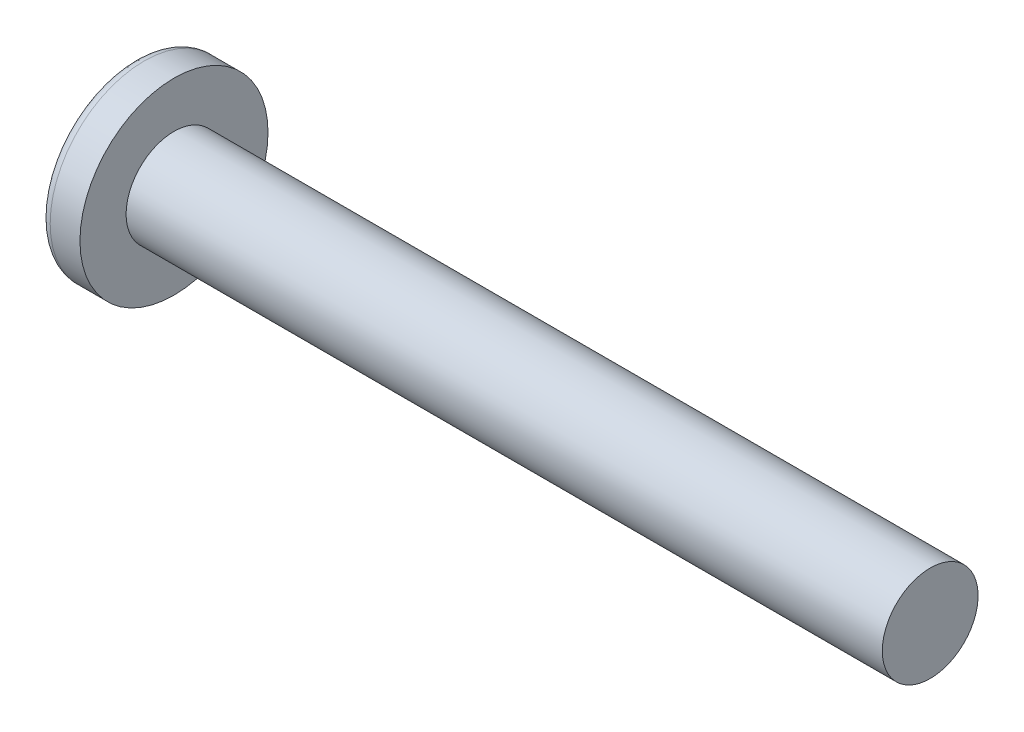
ISO-10303-21;
HEADER;
FILE_DESCRIPTION(('STEP AP214'),'2;1');
FILE_NAME('part.step','',(''),(''),'','','');
FILE_SCHEMA(('AUTOMOTIVE_DESIGN { 1 0 10303 214 1 1 1 1 }'));
ENDSEC;
DATA;
#1=APPLICATION_CONTEXT('core data for automotive mechanical design processes');
#2=APPLICATION_PROTOCOL_DEFINITION('international standard','automotive_design',2000,#1);
#3=PRODUCT_CONTEXT('',#1,'mechanical');
#4=PRODUCT('Part','Part','',(#3));
#5=PRODUCT_RELATED_PRODUCT_CATEGORY('part','',(#4));
#6=PRODUCT_DEFINITION_FORMATION('','',#4);
#7=PRODUCT_DEFINITION_CONTEXT('part definition',#1,'design');
#8=PRODUCT_DEFINITION('design','',#6,#7);
#9=PRODUCT_DEFINITION_SHAPE('','',#8);
#10=(LENGTH_UNIT() NAMED_UNIT(*) SI_UNIT(.MILLI.,.METRE.));
#11=(NAMED_UNIT(*) PLANE_ANGLE_UNIT() SI_UNIT($,.RADIAN.));
#12=(NAMED_UNIT(*) SI_UNIT($,.STERADIAN.) SOLID_ANGLE_UNIT());
#13=UNCERTAINTY_MEASURE_WITH_UNIT(LENGTH_MEASURE(1.E-05),#10,'distance_accuracy_value','');
#14=(GEOMETRIC_REPRESENTATION_CONTEXT(3) GLOBAL_UNCERTAINTY_ASSIGNED_CONTEXT((#13)) GLOBAL_UNIT_ASSIGNED_CONTEXT((#10,
#11,#12)) REPRESENTATION_CONTEXT('',''));
#15=CARTESIAN_POINT('',(0.,0.,0.));
#16=DIRECTION('',(0.,0.,1.));
#17=DIRECTION('',(1.,0.,0.));
#18=AXIS2_PLACEMENT_3D('',#15,#16,#17);
#19=CARTESIAN_POINT('',(3.4798,0.2921,-0.2921));
#20=DIRECTION('',(-1.,0.,0.));
#21=DIRECTION('',(0.,0.,1.));
#22=AXIS2_PLACEMENT_3D('',#19,#20,#21);
#23=PLANE('',#22);
#24=DIRECTION('',(0.,1.,0.));
#25=VECTOR('',#24,1.);
#26=CARTESIAN_POINT('',(3.4798,-0.292100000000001,0.292099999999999));
#27=LINE('',#26,#25);
#28=CARTESIAN_POINT('',(3.4798,-0.292100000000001,0.292099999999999));
#29=VERTEX_POINT('',#28);
#30=CARTESIAN_POINT('',(3.4798,0.292099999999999,0.2921));
#31=VERTEX_POINT('',#30);
#32=EDGE_CURVE('E95',#29,#31,#27,.T.);
#33=ORIENTED_EDGE('',*,*,#32,.T.);
#34=DIRECTION('',(0.,0.,1.));
#35=VECTOR('',#34,1.);
#36=CARTESIAN_POINT('',(3.4798,0.2921,0.2921));
#37=LINE('',#36,#35);
#38=CARTESIAN_POINT('',(3.4798,0.292100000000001,-0.2921));
#39=VERTEX_POINT('',#38);
#40=EDGE_CURVE('E178',#31,#39,#37,.F.);
#41=ORIENTED_EDGE('',*,*,#40,.T.);
#42=DIRECTION('',(0.,1.,0.));
#43=VECTOR('',#42,1.);
#44=CARTESIAN_POINT('',(3.4798,0.292100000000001,-0.292099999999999));
#45=LINE('',#44,#43);
#46=CARTESIAN_POINT('',(3.4798,-0.292099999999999,-0.2921));
#47=VERTEX_POINT('',#46);
#48=EDGE_CURVE('E98',#39,#47,#45,.F.);
#49=ORIENTED_EDGE('',*,*,#48,.T.);
#50=DIRECTION('',(0.,0.,1.));
#51=VECTOR('',#50,1.);
#52=CARTESIAN_POINT('',(3.4798,-0.2921,-0.2921));
#53=LINE('',#52,#51);
#54=EDGE_CURVE('E93',#47,#29,#53,.T.);
#55=ORIENTED_EDGE('',*,*,#54,.T.);
#56=EDGE_LOOP('',(#33,#41,#49,#55));
#57=FACE_BOUND('',#56,.T.);
#58=ADVANCED_FACE('F17',(#57),#23,.T.);
#59=CARTESIAN_POINT('',(3.4798,0.292100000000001,-0.292099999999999));
#60=DIRECTION('',(0.620849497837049,0.,-0.783929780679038));
#61=DIRECTION('',(-0.783929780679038,0.,-0.620849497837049));
#62=AXIS2_PLACEMENT_3D('',#59,#60,#61);
#63=PLANE('',#62);
#64=ORIENTED_EDGE('',*,*,#48,.F.);
#65=DIRECTION('',(0.782237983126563,-0.0656623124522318,0.619509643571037));
#66=VECTOR('',#65,1.);
#67=CARTESIAN_POINT('',(0.492297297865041,0.542875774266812,-2.65811491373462));
#68=LINE('',#67,#66);
#69=CARTESIAN_POINT('',(0.492297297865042,0.542875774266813,-2.65811491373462));
#70=VERTEX_POINT('',#69);
#71=EDGE_CURVE('E157',#70,#39,#68,.T.);
#72=ORIENTED_EDGE('',*,*,#71,.F.);
#73=CARTESIAN_POINT('',(0.492297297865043,-0.542875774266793,-2.65811491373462));
#74=CARTESIAN_POINT('',(0.481787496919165,-0.361917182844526,-2.66643836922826));
#75=CARTESIAN_POINT('',(0.476532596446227,-0.180958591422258,-2.67060009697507));
#76=CARTESIAN_POINT('',(0.476532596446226,0.180958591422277,-2.67060009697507));
#77=CARTESIAN_POINT('',(0.481787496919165,0.361917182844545,-2.66643836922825));
#78=CARTESIAN_POINT('',(0.492297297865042,0.542875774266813,-2.65811491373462));
#79=B_SPLINE_CURVE_WITH_KNOTS('',3,(#73,#74,#75,#76,#77,#78),.UNSPECIFIED.,.F.,.F.,(4,2,4),(0.,
0.543248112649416,1.08649622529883),.UNSPECIFIED.);
#80=CARTESIAN_POINT('',(0.492297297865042,-0.542875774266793,-2.65811491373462));
#81=VERTEX_POINT('',#80);
#82=EDGE_CURVE('E20',#81,#70,#79,.T.);
#83=ORIENTED_EDGE('',*,*,#82,.F.);
#84=DIRECTION('',(-0.782237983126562,-0.0656623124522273,-0.619509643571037));
#85=VECTOR('',#84,1.);
#86=CARTESIAN_POINT('',(3.4798,-0.292099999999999,-0.2921));
#87=LINE('',#86,#85);
#88=EDGE_CURVE('E162',#47,#81,#87,.T.);
#89=ORIENTED_EDGE('',*,*,#88,.F.);
#90=EDGE_LOOP('',(#64,#72,#83,#89));
#91=FACE_BOUND('',#90,.T.);
#92=ADVANCED_FACE('F290',(#91),#63,.F.);
#93=CARTESIAN_POINT('',(3.4798,0.2921,0.2921));
#94=DIRECTION('',(0.620849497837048,0.783929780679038,0.));
#95=DIRECTION('',(-0.783929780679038,0.620849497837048,0.));
#96=AXIS2_PLACEMENT_3D('',#93,#94,#95);
#97=PLANE('',#96);
#98=ORIENTED_EDGE('',*,*,#40,.F.);
#99=DIRECTION('',(0.782237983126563,-0.619509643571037,-0.0656623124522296));
#100=VECTOR('',#99,1.);
#101=CARTESIAN_POINT('',(0.492297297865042,2.65811491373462,0.542875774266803));
#102=LINE('',#101,#100);
#103=CARTESIAN_POINT('',(0.492297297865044,2.65811491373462,0.542875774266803));
#104=VERTEX_POINT('',#103);
#105=EDGE_CURVE('E142',#104,#31,#102,.T.);
#106=ORIENTED_EDGE('',*,*,#105,.F.);
#107=CARTESIAN_POINT('',(0.492297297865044,2.65811491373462,-0.542875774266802));
#108=CARTESIAN_POINT('',(0.48178749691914,2.66643836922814,-0.361917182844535));
#109=CARTESIAN_POINT('',(0.476532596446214,2.67060009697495,-0.180958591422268));
#110=CARTESIAN_POINT('',(0.476532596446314,2.67060009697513,0.180958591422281));
#111=CARTESIAN_POINT('',(0.481787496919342,2.6664383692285,0.361917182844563));
#112=CARTESIAN_POINT('',(0.492297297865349,2.65811491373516,0.542875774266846));
#113=B_SPLINE_CURVE_WITH_KNOTS('',3,(#107,#108,#109,#110,#111,#112),.UNSPECIFIED.,.F.,.F.,(4,2,
4),(0.,0.543248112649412,1.08649622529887),.UNSPECIFIED.);
#114=CARTESIAN_POINT('',(0.492297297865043,2.65811491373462,-0.542875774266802));
#115=VERTEX_POINT('',#114);
#116=EDGE_CURVE('E180',#115,#104,#113,.T.);
#117=ORIENTED_EDGE('',*,*,#116,.F.);
#118=DIRECTION('',(-0.782237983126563,0.619509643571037,-0.0656623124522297));
#119=VECTOR('',#118,1.);
#120=CARTESIAN_POINT('',(3.4798,0.292100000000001,-0.2921));
#121=LINE('',#120,#119);
#122=EDGE_CURVE('E147',#39,#115,#121,.T.);
#123=ORIENTED_EDGE('',*,*,#122,.F.);
#124=EDGE_LOOP('',(#98,#106,#117,#123));
#125=FACE_BOUND('',#124,.T.);
#126=ADVANCED_FACE('F287',(#125),#97,.F.);
#127=CARTESIAN_POINT('',(3.4798,-0.292100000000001,0.292099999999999));
#128=DIRECTION('',(0.620849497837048,0.,0.783929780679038));
#129=DIRECTION('',(0.783929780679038,0.,-0.620849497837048));
#130=AXIS2_PLACEMENT_3D('',#127,#128,#129);
#131=PLANE('',#130);
#132=ORIENTED_EDGE('',*,*,#32,.F.);
#133=DIRECTION('',(0.782237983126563,0.0656623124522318,-0.619509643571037));
#134=VECTOR('',#133,1.);
#135=CARTESIAN_POINT('',(0.492297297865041,-0.542875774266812,2.65811491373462));
#136=LINE('',#135,#134);
#137=CARTESIAN_POINT('',(0.492297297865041,-0.542875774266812,2.65811491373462));
#138=VERTEX_POINT('',#137);
#139=EDGE_CURVE('E106',#138,#29,#136,.T.);
#140=ORIENTED_EDGE('',*,*,#139,.F.);
#141=CARTESIAN_POINT('',(0.492297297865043,0.542875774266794,2.65811491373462));
#142=CARTESIAN_POINT('',(0.481787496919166,0.361917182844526,2.66643836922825));
#143=CARTESIAN_POINT('',(0.476532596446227,0.180958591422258,2.67060009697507));
#144=CARTESIAN_POINT('',(0.476532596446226,-0.180958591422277,2.67060009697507));
#145=CARTESIAN_POINT('',(0.481787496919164,-0.361917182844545,2.66643836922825));
#146=CARTESIAN_POINT('',(0.492297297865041,-0.542875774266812,2.65811491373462));
#147=B_SPLINE_CURVE_WITH_KNOTS('',3,(#141,#142,#143,#144,#145,#146),.UNSPECIFIED.,.F.,.F.,(4,2,
4),(0.,0.543248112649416,1.08649622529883),.UNSPECIFIED.);
#148=CARTESIAN_POINT('',(0.492297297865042,0.542875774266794,2.65811491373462));
#149=VERTEX_POINT('',#148);
#150=EDGE_CURVE('E111',#149,#138,#147,.T.);
#151=ORIENTED_EDGE('',*,*,#150,.F.);
#152=DIRECTION('',(-0.782237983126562,0.0656623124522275,0.619509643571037));
#153=VECTOR('',#152,1.);
#154=CARTESIAN_POINT('',(3.4798,0.292099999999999,0.2921));
#155=LINE('',#154,#153);
#156=EDGE_CURVE('E109',#31,#149,#155,.T.);
#157=ORIENTED_EDGE('',*,*,#156,.F.);
#158=EDGE_LOOP('',(#132,#140,#151,#157));
#159=FACE_BOUND('',#158,.T.);
#160=ADVANCED_FACE('F105',(#159),#131,.F.);
#161=CARTESIAN_POINT('',(3.4798,-0.2921,-0.2921));
#162=DIRECTION('',(0.620849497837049,-0.783929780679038,0.));
#163=DIRECTION('',(0.783929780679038,0.620849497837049,0.));
#164=AXIS2_PLACEMENT_3D('',#161,#162,#163);
#165=PLANE('',#164);
#166=ORIENTED_EDGE('',*,*,#54,.F.);
#167=DIRECTION('',(0.782237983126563,0.619509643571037,0.0656623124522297));
#168=VECTOR('',#167,1.);
#169=CARTESIAN_POINT('',(0.492297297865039,-2.65811491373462,-0.542875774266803));
#170=LINE('',#169,#168);
#171=CARTESIAN_POINT('',(0.492297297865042,-2.65811491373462,-0.542875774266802));
#172=VERTEX_POINT('',#171);
#173=EDGE_CURVE('E99',#172,#47,#170,.T.);
#174=ORIENTED_EDGE('',*,*,#173,.F.);
#175=CARTESIAN_POINT('',(0.49229729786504,-2.65811491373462,0.5428757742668));
#176=CARTESIAN_POINT('',(0.481787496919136,-2.66643836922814,0.361917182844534));
#177=CARTESIAN_POINT('',(0.47653259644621,-2.67060009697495,0.180958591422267));
#178=CARTESIAN_POINT('',(0.476532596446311,-2.67060009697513,-0.180958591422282));
#179=CARTESIAN_POINT('',(0.48178749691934,-2.66643836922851,-0.361917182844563));
#180=CARTESIAN_POINT('',(0.492297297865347,-2.65811491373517,-0.542875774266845));
#181=B_SPLINE_CURVE_WITH_KNOTS('',3,(#175,#176,#177,#178,#179,#180),.UNSPECIFIED.,.F.,.F.,(4,2,
4),(0.,0.543248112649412,1.08649622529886),.UNSPECIFIED.);
#182=CARTESIAN_POINT('',(0.49229729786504,-2.65811491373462,0.542875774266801));
#183=VERTEX_POINT('',#182);
#184=EDGE_CURVE('E39',#183,#172,#181,.T.);
#185=ORIENTED_EDGE('',*,*,#184,.F.);
#186=DIRECTION('',(-0.782237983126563,-0.619509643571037,0.0656623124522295));
#187=VECTOR('',#186,1.);
#188=CARTESIAN_POINT('',(3.4798,-0.292100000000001,0.2921));
#189=LINE('',#188,#187);
#190=EDGE_CURVE('E121',#29,#183,#189,.T.);
#191=ORIENTED_EDGE('',*,*,#190,.F.);
#192=EDGE_LOOP('',(#166,#174,#185,#191));
#193=FACE_BOUND('',#192,.T.);
#194=ADVANCED_FACE('F122',(#193),#165,.F.);
#195=CARTESIAN_POINT('',(3.8486267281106,0.,-0.261140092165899));
#196=DIRECTION('',(-0.0836474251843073,0.,0.996495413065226));
#197=DIRECTION('',(0.996495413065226,0.,0.0836474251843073));
#198=AXIS2_PLACEMENT_3D('',#195,#196,#197);
#199=PLANE('',#198);
#200=DIRECTION('',(0.993027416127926,0.0833563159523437,0.0833563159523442));
#201=VECTOR('',#200,1.);
#202=CARTESIAN_POINT('',(0.0437691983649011,-0.580525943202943,-0.580525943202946));
#203=LINE('',#202,#201);
#204=CARTESIAN_POINT('',(0.0437691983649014,-0.580525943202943,-0.580525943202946));
#205=VERTEX_POINT('',#204);
#206=EDGE_CURVE('E73',#205,#47,#203,.T.);
#207=ORIENTED_EDGE('',*,*,#206,.F.);
#208=CARTESIAN_POINT('',(0.492297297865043,-2.65811491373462,-0.542875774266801));
#209=CARTESIAN_POINT('',(0.461687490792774,-2.57434226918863,-0.545445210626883));
#210=CARTESIAN_POINT('',(0.43252593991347,-2.4900367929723,-0.54789307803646));
#211=CARTESIAN_POINT('',(0.377230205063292,-2.32076418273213,-0.552534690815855));
#212=CARTESIAN_POINT('',(0.351085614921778,-2.23580047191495,-0.554729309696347));
#213=CARTESIAN_POINT('',(0.301794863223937,-2.06522014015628,-0.558866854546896));
#214=CARTESIAN_POINT('',(0.278641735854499,-1.9796055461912,-0.560810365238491));
#215=CARTESIAN_POINT('',(0.2353145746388,-1.80772917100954,-0.5644473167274));
#216=CARTESIAN_POINT('',(0.215137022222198,-1.72146828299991,-0.566141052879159));
#217=CARTESIAN_POINT('',(0.177752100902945,-1.54830075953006,-0.569279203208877));
#218=CARTESIAN_POINT('',(0.160544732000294,-1.46139412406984,-0.570723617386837));
#219=CARTESIAN_POINT('',(0.129101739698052,-1.28693401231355,-0.573362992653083));
#220=CARTESIAN_POINT('',(0.11486968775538,-1.19937988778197,-0.574557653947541));
#221=CARTESIAN_POINT('',(0.089390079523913,-1.0236227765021,-0.57669645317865));
#222=CARTESIAN_POINT('',(0.0781497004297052,-0.935418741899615,-0.577639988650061));
#223=CARTESIAN_POINT('',(0.0586759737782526,-0.758358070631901,-0.579274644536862));
#224=CARTESIAN_POINT('',(0.0504535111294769,-0.669500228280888,-0.579964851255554));
#225=CARTESIAN_POINT('',(0.0437691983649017,-0.580525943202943,-0.580525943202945));
#226=B_SPLINE_CURVE_WITH_KNOTS('',3,(#208,#209,#210,#211,#212,#213,#214,#215,#216,#217,#218,
#219,#220,#221,#222,#223,#224,#225),.UNSPECIFIED.,.F.,.F.,(4,2,2,2,2,2,2,2,4),(0.,
0.267666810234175,0.534380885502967,0.800462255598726,1.06622642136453,1.33199058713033,
1.59807195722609,1.86478603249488,2.13245284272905),.UNSPECIFIED.);
#227=EDGE_CURVE('E125',#172,#205,#226,.T.);
#228=ORIENTED_EDGE('',*,*,#227,.F.);
#229=ORIENTED_EDGE('',*,*,#173,.T.);
#230=EDGE_LOOP('',(#207,#228,#229));
#231=FACE_BOUND('',#230,.T.);
#232=ADVANCED_FACE('F259',(#231),#199,.T.);
#233=CARTESIAN_POINT('',(3.8486267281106,-0.261140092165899,0.));
#234=DIRECTION('',(-0.0836474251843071,0.996495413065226,0.));
#235=DIRECTION('',(-0.996495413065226,-0.0836474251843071,0.));
#236=AXIS2_PLACEMENT_3D('',#233,#234,#235);
#237=PLANE('',#236);
#238=ORIENTED_EDGE('',*,*,#206,.T.);
#239=ORIENTED_EDGE('',*,*,#88,.T.);
#240=CARTESIAN_POINT('',(0.0437691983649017,-0.580525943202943,-0.580525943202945));
#241=CARTESIAN_POINT('',(0.0504535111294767,-0.579964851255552,-0.66950022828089));
#242=CARTESIAN_POINT('',(0.0586759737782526,-0.579274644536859,-0.758358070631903));
#243=CARTESIAN_POINT('',(0.0781497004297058,-0.577639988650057,-0.935418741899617));
#244=CARTESIAN_POINT('',(0.0893900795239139,-0.576696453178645,-1.0236227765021));
#245=CARTESIAN_POINT('',(0.114869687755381,-0.574557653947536,-1.19937988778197));
#246=CARTESIAN_POINT('',(0.129101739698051,-0.573362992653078,-1.28693401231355));
#247=CARTESIAN_POINT('',(0.160544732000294,-0.570723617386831,-1.46139412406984));
#248=CARTESIAN_POINT('',(0.177752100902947,-0.569279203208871,-1.54830075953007));
#249=CARTESIAN_POINT('',(0.215137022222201,-0.566141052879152,-1.72146828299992));
#250=CARTESIAN_POINT('',(0.235314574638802,-0.564447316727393,-1.80772917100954));
#251=CARTESIAN_POINT('',(0.278641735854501,-0.560810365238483,-1.97960554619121));
#252=CARTESIAN_POINT('',(0.301794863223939,-0.558866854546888,-2.06522014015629));
#253=CARTESIAN_POINT('',(0.35108561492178,-0.554729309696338,-2.23580047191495));
#254=CARTESIAN_POINT('',(0.377230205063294,-0.552534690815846,-2.32076418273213));
#255=CARTESIAN_POINT('',(0.432525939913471,-0.547893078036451,-2.4900367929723));
#256=CARTESIAN_POINT('',(0.461687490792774,-0.545445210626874,-2.57434226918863));
#257=CARTESIAN_POINT('',(0.492297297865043,-0.542875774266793,-2.65811491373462));
#258=B_SPLINE_CURVE_WITH_KNOTS('',3,(#240,#241,#242,#243,#244,#245,#246,#247,#248,#249,#250,
#251,#252,#253,#254,#255,#256,#257),.UNSPECIFIED.,.F.,.F.,(4,2,2,2,2,2,2,2,4),(0.,
0.267666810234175,0.534380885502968,0.800462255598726,1.06622642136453,1.33199058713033,
1.59807195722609,1.86478603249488,2.13245284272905),.UNSPECIFIED.);
#259=EDGE_CURVE('E263',#205,#81,#258,.T.);
#260=ORIENTED_EDGE('',*,*,#259,.F.);
#261=EDGE_LOOP('',(#238,#239,#260));
#262=FACE_BOUND('',#261,.T.);
#263=ADVANCED_FACE('F254',(#262),#237,.T.);
#264=CARTESIAN_POINT('',(3.8486267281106,0.261140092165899,0.));
#265=DIRECTION('',(-0.0836474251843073,-0.996495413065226,0.));
#266=DIRECTION('',(0.996495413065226,-0.0836474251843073,0.));
#267=AXIS2_PLACEMENT_3D('',#264,#265,#266);
#268=PLANE('',#267);
#269=ORIENTED_EDGE('',*,*,#71,.T.);
#270=DIRECTION('',(0.993027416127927,-0.0833563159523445,0.0833563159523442));
#271=VECTOR('',#270,1.);
#272=CARTESIAN_POINT('',(0.0437691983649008,0.580525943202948,-0.580525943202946));
#273=LINE('',#272,#271);
#274=CARTESIAN_POINT('',(0.0437691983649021,0.580525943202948,-0.580525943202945));
#275=VERTEX_POINT('',#274);
#276=EDGE_CURVE('E152',#275,#39,#273,.T.);
#277=ORIENTED_EDGE('',*,*,#276,.F.);
#278=CARTESIAN_POINT('',(0.492297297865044,0.542875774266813,-2.65811491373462));
#279=CARTESIAN_POINT('',(0.461687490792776,0.545445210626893,-2.57434226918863));
#280=CARTESIAN_POINT('',(0.432525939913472,0.547893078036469,-2.4900367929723));
#281=CARTESIAN_POINT('',(0.377230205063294,0.552534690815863,-2.32076418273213));
#282=CARTESIAN_POINT('',(0.351085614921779,0.554729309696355,-2.23580047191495));
#283=CARTESIAN_POINT('',(0.301794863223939,0.558866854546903,-2.06522014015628));
#284=CARTESIAN_POINT('',(0.278641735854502,0.560810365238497,-1.9796055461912));
#285=CARTESIAN_POINT('',(0.235314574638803,0.564447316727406,-1.80772917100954));
#286=CARTESIAN_POINT('',(0.215137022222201,0.566141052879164,-1.72146828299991));
#287=CARTESIAN_POINT('',(0.177752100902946,0.569279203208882,-1.54830075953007));
#288=CARTESIAN_POINT('',(0.160544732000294,0.570723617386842,-1.46139412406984));
#289=CARTESIAN_POINT('',(0.129101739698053,0.573362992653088,-1.28693401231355));
#290=CARTESIAN_POINT('',(0.114869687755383,0.574557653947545,-1.19937988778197));
#291=CARTESIAN_POINT('',(0.0893900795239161,0.576696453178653,-1.0236227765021));
#292=CARTESIAN_POINT('',(0.0781497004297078,0.577639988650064,-0.935418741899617));
#293=CARTESIAN_POINT('',(0.0586759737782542,0.579274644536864,-0.758358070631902));
#294=CARTESIAN_POINT('',(0.0504535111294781,0.579964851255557,-0.66950022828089));
#295=CARTESIAN_POINT('',(0.0437691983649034,0.580525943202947,-0.580525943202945));
#296=B_SPLINE_CURVE_WITH_KNOTS('',3,(#278,#279,#280,#281,#282,#283,#284,#285,#286,#287,#288,
#289,#290,#291,#292,#293,#294,#295),.UNSPECIFIED.,.F.,.F.,(4,2,2,2,2,2,2,2,4),(0.,
0.267666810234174,0.534380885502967,0.800462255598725,1.06622642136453,1.33199058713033,
1.59807195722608,1.86478603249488,2.13245284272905),.UNSPECIFIED.);
#297=EDGE_CURVE('E240',#70,#275,#296,.T.);
#298=ORIENTED_EDGE('',*,*,#297,.F.);
#299=EDGE_LOOP('',(#269,#277,#298));
#300=FACE_BOUND('',#299,.T.);
#301=ADVANCED_FACE('F249',(#300),#268,.T.);
#302=CARTESIAN_POINT('',(3.8486267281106,0.,-0.261140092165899));
#303=DIRECTION('',(-0.0836474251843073,0.,0.996495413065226));
#304=DIRECTION('',(0.996495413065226,0.,0.0836474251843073));
#305=AXIS2_PLACEMENT_3D('',#302,#303,#304);
#306=PLANE('',#305);
#307=ORIENTED_EDGE('',*,*,#276,.T.);
#308=ORIENTED_EDGE('',*,*,#122,.T.);
#309=CARTESIAN_POINT('',(0.0437691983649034,0.580525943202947,-0.580525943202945));
#310=CARTESIAN_POINT('',(0.0504535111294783,0.669500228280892,-0.579964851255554));
#311=CARTESIAN_POINT('',(0.0586759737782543,0.758358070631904,-0.579274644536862));
#312=CARTESIAN_POINT('',(0.0781497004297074,0.935418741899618,-0.577639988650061));
#313=CARTESIAN_POINT('',(0.0893900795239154,1.0236227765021,-0.576696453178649));
#314=CARTESIAN_POINT('',(0.114869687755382,1.19937988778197,-0.574557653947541));
#315=CARTESIAN_POINT('',(0.129101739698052,1.28693401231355,-0.573362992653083));
#316=CARTESIAN_POINT('',(0.160544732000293,1.46139412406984,-0.570723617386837));
#317=CARTESIAN_POINT('',(0.177752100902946,1.54830075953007,-0.569279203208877));
#318=CARTESIAN_POINT('',(0.215137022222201,1.72146828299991,-0.566141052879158));
#319=CARTESIAN_POINT('',(0.235314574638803,1.80772917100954,-0.5644473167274));
#320=CARTESIAN_POINT('',(0.278641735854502,1.9796055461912,-0.56081036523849));
#321=CARTESIAN_POINT('',(0.30179486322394,2.06522014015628,-0.558866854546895));
#322=CARTESIAN_POINT('',(0.351085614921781,2.23580047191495,-0.554729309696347));
#323=CARTESIAN_POINT('',(0.377230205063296,2.32076418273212,-0.552534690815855));
#324=CARTESIAN_POINT('',(0.432525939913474,2.4900367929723,-0.54789307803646));
#325=CARTESIAN_POINT('',(0.461687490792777,2.57434226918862,-0.545445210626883));
#326=CARTESIAN_POINT('',(0.492297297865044,2.65811491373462,-0.542875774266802));
#327=B_SPLINE_CURVE_WITH_KNOTS('',3,(#309,#310,#311,#312,#313,#314,#315,#316,#317,#318,#319,
#320,#321,#322,#323,#324,#325,#326),.UNSPECIFIED.,.F.,.F.,(4,2,2,2,2,2,2,2,4),(0.,
0.267666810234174,0.534380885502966,0.800462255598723,1.06622642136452,1.33199058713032,
1.59807195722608,1.86478603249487,2.13245284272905),.UNSPECIFIED.);
#328=EDGE_CURVE('E234',#275,#115,#327,.T.);
#329=ORIENTED_EDGE('',*,*,#328,.F.);
#330=EDGE_LOOP('',(#307,#308,#329));
#331=FACE_BOUND('',#330,.T.);
#332=ADVANCED_FACE('F246',(#331),#306,.T.);
#333=CARTESIAN_POINT('',(3.8486267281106,0.,0.261140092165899));
#334=DIRECTION('',(-0.0836474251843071,0.,-0.996495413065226));
#335=DIRECTION('',(-0.996495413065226,0.,0.0836474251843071));
#336=AXIS2_PLACEMENT_3D('',#333,#334,#335);
#337=PLANE('',#336);
#338=DIRECTION('',(0.993027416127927,-0.0833563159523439,-0.083356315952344));
#339=VECTOR('',#338,1.);
#340=CARTESIAN_POINT('',(0.0437691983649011,0.580525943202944,0.580525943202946));
#341=LINE('',#340,#339);
#342=CARTESIAN_POINT('',(0.0437691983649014,0.580525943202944,0.580525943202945));
#343=VERTEX_POINT('',#342);
#344=EDGE_CURVE('E138',#343,#31,#341,.T.);
#345=ORIENTED_EDGE('',*,*,#344,.F.);
#346=CARTESIAN_POINT('',(0.492297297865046,2.65811491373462,0.542875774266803));
#347=CARTESIAN_POINT('',(0.461687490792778,2.57434226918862,0.545445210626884));
#348=CARTESIAN_POINT('',(0.432525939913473,2.4900367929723,0.54789307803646));
#349=CARTESIAN_POINT('',(0.377230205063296,2.32076418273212,0.552534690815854));
#350=CARTESIAN_POINT('',(0.351085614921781,2.23580047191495,0.554729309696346));
#351=CARTESIAN_POINT('',(0.30179486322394,2.06522014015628,0.558866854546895));
#352=CARTESIAN_POINT('',(0.278641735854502,1.9796055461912,0.56081036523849));
#353=CARTESIAN_POINT('',(0.235314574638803,1.80772917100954,0.564447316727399));
#354=CARTESIAN_POINT('',(0.215137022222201,1.72146828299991,0.566141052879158));
#355=CARTESIAN_POINT('',(0.177752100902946,1.54830075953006,0.569279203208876));
#356=CARTESIAN_POINT('',(0.160544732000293,1.46139412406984,0.570723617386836));
#357=CARTESIAN_POINT('',(0.129101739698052,1.28693401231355,0.573362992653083));
#358=CARTESIAN_POINT('',(0.114869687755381,1.19937988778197,0.574557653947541));
#359=CARTESIAN_POINT('',(0.0893900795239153,1.0236227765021,0.576696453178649));
#360=CARTESIAN_POINT('',(0.0781497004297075,0.935418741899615,0.57763998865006));
#361=CARTESIAN_POINT('',(0.0586759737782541,0.758358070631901,0.579274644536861));
#362=CARTESIAN_POINT('',(0.0504535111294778,0.669500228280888,0.579964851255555));
#363=CARTESIAN_POINT('',(0.0437691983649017,0.580525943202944,0.580525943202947));
#364=B_SPLINE_CURVE_WITH_KNOTS('',3,(#346,#347,#348,#349,#350,#351,#352,#353,#354,#355,#356,
#357,#358,#359,#360,#361,#362,#363),.UNSPECIFIED.,.F.,.F.,(4,2,2,2,2,2,2,2,4),(0.,
0.267666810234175,0.534380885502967,0.800462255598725,1.06622642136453,1.33199058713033,
1.59807195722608,1.86478603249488,2.13245284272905),.UNSPECIFIED.);
#365=EDGE_CURVE('E228',#104,#343,#364,.T.);
#366=ORIENTED_EDGE('',*,*,#365,.F.);
#367=ORIENTED_EDGE('',*,*,#105,.T.);
#368=EDGE_LOOP('',(#345,#366,#367));
#369=FACE_BOUND('',#368,.T.);
#370=ADVANCED_FACE('F218',(#369),#337,.T.);
#371=CARTESIAN_POINT('',(3.8486267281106,0.261140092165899,0.));
#372=DIRECTION('',(-0.0836474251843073,-0.996495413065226,0.));
#373=DIRECTION('',(0.996495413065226,-0.0836474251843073,0.));
#374=AXIS2_PLACEMENT_3D('',#371,#372,#373);
#375=PLANE('',#374);
#376=ORIENTED_EDGE('',*,*,#344,.T.);
#377=ORIENTED_EDGE('',*,*,#156,.T.);
#378=CARTESIAN_POINT('',(0.0437691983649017,0.580525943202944,0.580525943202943));
#379=CARTESIAN_POINT('',(0.0504535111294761,0.579964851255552,0.669500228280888));
#380=CARTESIAN_POINT('',(0.0586759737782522,0.579274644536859,0.758358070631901));
#381=CARTESIAN_POINT('',(0.0781497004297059,0.577639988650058,0.935418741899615));
#382=CARTESIAN_POINT('',(0.0893900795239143,0.576696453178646,1.0236227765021));
#383=CARTESIAN_POINT('',(0.114869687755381,0.574557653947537,1.19937988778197));
#384=CARTESIAN_POINT('',(0.129101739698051,0.573362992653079,1.28693401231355));
#385=CARTESIAN_POINT('',(0.160544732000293,0.570723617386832,1.46139412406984));
#386=CARTESIAN_POINT('',(0.177752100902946,0.569279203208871,1.54830075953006));
#387=CARTESIAN_POINT('',(0.2151370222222,0.566141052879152,1.72146828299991));
#388=CARTESIAN_POINT('',(0.235314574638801,0.564447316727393,1.80772917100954));
#389=CARTESIAN_POINT('',(0.2786417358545,0.560810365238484,1.9796055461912));
#390=CARTESIAN_POINT('',(0.301794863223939,0.558866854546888,2.06522014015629));
#391=CARTESIAN_POINT('',(0.35108561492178,0.554729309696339,2.23580047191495));
#392=CARTESIAN_POINT('',(0.377230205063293,0.552534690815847,2.32076418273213));
#393=CARTESIAN_POINT('',(0.43252593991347,0.547893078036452,2.4900367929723));
#394=CARTESIAN_POINT('',(0.461687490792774,0.545445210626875,2.57434226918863));
#395=CARTESIAN_POINT('',(0.492297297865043,0.542875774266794,2.65811491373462));
#396=B_SPLINE_CURVE_WITH_KNOTS('',3,(#378,#379,#380,#381,#382,#383,#384,#385,#386,#387,#388,
#389,#390,#391,#392,#393,#394,#395),.UNSPECIFIED.,.F.,.F.,(4,2,2,2,2,2,2,2,4),(0.,
0.267666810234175,0.534380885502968,0.800462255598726,1.06622642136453,1.33199058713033,
1.59807195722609,1.86478603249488,2.13245284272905),.UNSPECIFIED.);
#397=EDGE_CURVE('E222',#343,#149,#396,.T.);
#398=ORIENTED_EDGE('',*,*,#397,.F.);
#399=EDGE_LOOP('',(#376,#377,#398));
#400=FACE_BOUND('',#399,.T.);
#401=ADVANCED_FACE('F214',(#400),#375,.T.);
#402=CARTESIAN_POINT('',(3.8486267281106,-0.261140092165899,0.));
#403=DIRECTION('',(-0.0836474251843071,0.996495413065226,0.));
#404=DIRECTION('',(-0.996495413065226,-0.0836474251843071,0.));
#405=AXIS2_PLACEMENT_3D('',#402,#403,#404);
#406=PLANE('',#405);
#407=ORIENTED_EDGE('',*,*,#139,.T.);
#408=DIRECTION('',(0.993027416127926,0.0833563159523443,-0.083356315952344));
#409=VECTOR('',#408,1.);
#410=CARTESIAN_POINT('',(0.0437691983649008,-0.580525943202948,0.580525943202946));
#411=LINE('',#410,#409);
#412=CARTESIAN_POINT('',(0.0437691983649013,-0.580525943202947,0.580525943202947));
#413=VERTEX_POINT('',#412);
#414=EDGE_CURVE('E116',#413,#29,#411,.T.);
#415=ORIENTED_EDGE('',*,*,#414,.F.);
#416=CARTESIAN_POINT('',(0.492297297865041,-0.542875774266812,2.65811491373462));
#417=CARTESIAN_POINT('',(0.461687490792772,-0.545445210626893,2.57434226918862));
#418=CARTESIAN_POINT('',(0.432525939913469,-0.547893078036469,2.4900367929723));
#419=CARTESIAN_POINT('',(0.377230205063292,-0.552534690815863,2.32076418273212));
#420=CARTESIAN_POINT('',(0.351085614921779,-0.554729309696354,2.23580047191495));
#421=CARTESIAN_POINT('',(0.301794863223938,-0.558866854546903,2.06522014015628));
#422=CARTESIAN_POINT('',(0.2786417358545,-0.560810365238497,1.9796055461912));
#423=CARTESIAN_POINT('',(0.235314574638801,-0.564447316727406,1.80772917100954));
#424=CARTESIAN_POINT('',(0.2151370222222,-0.566141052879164,1.72146828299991));
#425=CARTESIAN_POINT('',(0.177752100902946,-0.569279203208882,1.54830075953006));
#426=CARTESIAN_POINT('',(0.160544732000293,-0.570723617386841,1.46139412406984));
#427=CARTESIAN_POINT('',(0.12910173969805,-0.573362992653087,1.28693401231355));
#428=CARTESIAN_POINT('',(0.114869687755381,-0.574557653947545,1.19937988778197));
#429=CARTESIAN_POINT('',(0.0893900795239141,-0.576696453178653,1.0236227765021));
#430=CARTESIAN_POINT('',(0.0781497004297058,-0.577639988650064,0.935418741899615));
#431=CARTESIAN_POINT('',(0.0586759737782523,-0.579274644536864,0.758358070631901));
#432=CARTESIAN_POINT('',(0.0504535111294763,-0.579964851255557,0.669500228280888));
#433=CARTESIAN_POINT('',(0.0437691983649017,-0.580525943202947,0.580525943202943));
#434=B_SPLINE_CURVE_WITH_KNOTS('',3,(#416,#417,#418,#419,#420,#421,#422,#423,#424,#425,#426,
#427,#428,#429,#430,#431,#432,#433),.UNSPECIFIED.,.F.,.F.,(4,2,2,2,2,2,2,2,4),(0.,
0.267666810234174,0.534380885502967,0.800462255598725,1.06622642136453,1.33199058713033,
1.59807195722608,1.86478603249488,2.13245284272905),.UNSPECIFIED.);
#435=EDGE_CURVE('E119',#138,#413,#434,.T.);
#436=ORIENTED_EDGE('',*,*,#435,.F.);
#437=EDGE_LOOP('',(#407,#415,#436));
#438=FACE_BOUND('',#437,.T.);
#439=ADVANCED_FACE('F114',(#438),#406,.T.);
#440=CARTESIAN_POINT('',(3.8486267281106,0.,0.261140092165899));
#441=DIRECTION('',(-0.0836474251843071,0.,-0.996495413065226));
#442=DIRECTION('',(-0.996495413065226,0.,0.0836474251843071));
#443=AXIS2_PLACEMENT_3D('',#440,#441,#442);
#444=PLANE('',#443);
#445=ORIENTED_EDGE('',*,*,#414,.T.);
#446=ORIENTED_EDGE('',*,*,#190,.T.);
#447=CARTESIAN_POINT('',(0.0437691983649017,-0.580525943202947,0.580525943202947));
#448=CARTESIAN_POINT('',(0.0504535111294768,-0.669500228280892,0.579964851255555));
#449=CARTESIAN_POINT('',(0.0586759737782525,-0.758358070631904,0.579274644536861));
#450=CARTESIAN_POINT('',(0.0781497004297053,-0.935418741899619,0.57763998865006));
#451=CARTESIAN_POINT('',(0.0893900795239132,-1.0236227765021,0.576696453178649));
#452=CARTESIAN_POINT('',(0.11486968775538,-1.19937988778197,0.574557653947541));
#453=CARTESIAN_POINT('',(0.129101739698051,-1.28693401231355,0.573362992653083));
#454=CARTESIAN_POINT('',(0.160544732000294,-1.46139412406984,0.570723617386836));
#455=CARTESIAN_POINT('',(0.177752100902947,-1.54830075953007,0.569279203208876));
#456=CARTESIAN_POINT('',(0.215137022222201,-1.72146828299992,0.566141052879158));
#457=CARTESIAN_POINT('',(0.235314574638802,-1.80772917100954,0.564447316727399));
#458=CARTESIAN_POINT('',(0.2786417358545,-1.97960554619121,0.56081036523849));
#459=CARTESIAN_POINT('',(0.301794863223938,-2.06522014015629,0.558866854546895));
#460=CARTESIAN_POINT('',(0.351085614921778,-2.23580047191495,0.554729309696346));
#461=CARTESIAN_POINT('',(0.377230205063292,-2.32076418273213,0.552534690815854));
#462=CARTESIAN_POINT('',(0.43252593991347,-2.4900367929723,0.54789307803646));
#463=CARTESIAN_POINT('',(0.461687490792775,-2.57434226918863,0.545445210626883));
#464=CARTESIAN_POINT('',(0.492297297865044,-2.65811491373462,0.542875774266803));
#465=B_SPLINE_CURVE_WITH_KNOTS('',3,(#447,#448,#449,#450,#451,#452,#453,#454,#455,#456,#457,
#458,#459,#460,#461,#462,#463,#464),.UNSPECIFIED.,.F.,.F.,(4,2,2,2,2,2,2,2,4),(0.,
0.267666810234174,0.534380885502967,0.800462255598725,1.06622642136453,1.33199058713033,
1.59807195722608,1.86478603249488,2.13245284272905),.UNSPECIFIED.);
#466=EDGE_CURVE('E128',#413,#183,#465,.T.);
#467=ORIENTED_EDGE('',*,*,#466,.F.);
#468=EDGE_LOOP('',(#445,#446,#467));
#469=FACE_BOUND('',#468,.T.);
#470=ADVANCED_FACE('F127',(#469),#444,.T.);
#471=CARTESIAN_POINT('',(7.7216,0.,0.));
#472=DIRECTION('',(0.,1.,0.));
#473=DIRECTION('',(1.,0.,0.));
#474=AXIS2_PLACEMENT_3D('',#471,#472,#473);
#475=SPHERICAL_SURFACE('',#474,7.7216);
#476=CARTESIAN_POINT('',(1.46619704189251,0.,0.));
#477=DIRECTION('',(-1.,0.,0.));
#478=DIRECTION('',(0.,0.,1.));
#479=AXIS2_PLACEMENT_3D('',#476,#477,#478);
#480=CIRCLE('',#479,4.52692394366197);
#481=CARTESIAN_POINT('',(1.46619704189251,0.,4.52692394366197));
#482=VERTEX_POINT('',#481);
#483=EDGE_CURVE('E192',#482,#482,#480,.F.);
#484=ORIENTED_EDGE('',*,*,#483,.F.);
#485=EDGE_LOOP('',(#484));
#486=FACE_BOUND('',#485,.T.);
#487=ORIENTED_EDGE('',*,*,#466,.T.);
#488=ORIENTED_EDGE('',*,*,#184,.T.);
#489=ORIENTED_EDGE('',*,*,#227,.T.);
#490=ORIENTED_EDGE('',*,*,#259,.T.);
#491=ORIENTED_EDGE('',*,*,#82,.T.);
#492=ORIENTED_EDGE('',*,*,#297,.T.);
#493=ORIENTED_EDGE('',*,*,#328,.T.);
#494=ORIENTED_EDGE('',*,*,#116,.T.);
#495=ORIENTED_EDGE('',*,*,#365,.T.);
#496=ORIENTED_EDGE('',*,*,#397,.T.);
#497=ORIENTED_EDGE('',*,*,#150,.T.);
#498=ORIENTED_EDGE('',*,*,#435,.T.);
#499=EDGE_LOOP('',(#487,#488,#489,#490,#491,#492,#493,#494,#495,#496,#497,#498));
#500=FACE_BOUND('',#499,.T.);
#501=ADVANCED_FACE('F205',(#486,#500),#475,.T.);
#502=CARTESIAN_POINT('',(1.87773671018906,0.,0.));
#503=DIRECTION('',(-1.,0.,0.));
#504=DIRECTION('',(0.,0.,1.));
#505=AXIS2_PLACEMENT_3D('',#502,#503,#504);
#506=TOROIDAL_SURFACE('',#505,4.2291,0.508);
#507=ORIENTED_EDGE('',*,*,#483,.T.);
#508=EDGE_LOOP('',(#507));
#509=FACE_BOUND('',#508,.T.);
#510=CARTESIAN_POINT('',(1.87773671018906,0.,0.));
#511=DIRECTION('',(-1.,0.,0.));
#512=DIRECTION('',(0.,0.,1.));
#513=AXIS2_PLACEMENT_3D('',#510,#511,#512);
#514=CIRCLE('',#513,4.7371);
#515=CARTESIAN_POINT('',(1.87773671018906,0.,4.7371));
#516=VERTEX_POINT('',#515);
#517=EDGE_CURVE('E191',#516,#516,#514,.F.);
#518=ORIENTED_EDGE('',*,*,#517,.F.);
#519=EDGE_LOOP('',(#518));
#520=FACE_BOUND('',#519,.T.);
#521=ADVANCED_FACE('F326',(#509,#520),#506,.T.);
#522=CARTESIAN_POINT('',(-25.4,0.,0.));
#523=DIRECTION('',(-1.,0.,0.));
#524=DIRECTION('',(0.,0.,1.));
#525=AXIS2_PLACEMENT_3D('',#522,#523,#524);
#526=CYLINDRICAL_SURFACE('',#525,4.7371);
#527=ORIENTED_EDGE('',*,*,#517,.T.);
#528=EDGE_LOOP('',(#527));
#529=FACE_BOUND('',#528,.T.);
#530=CARTESIAN_POINT('',(3.3782,0.,0.));
#531=DIRECTION('',(-1.,0.,0.));
#532=DIRECTION('',(0.,0.,1.));
#533=AXIS2_PLACEMENT_3D('',#530,#531,#532);
#534=CIRCLE('',#533,4.7371);
#535=CARTESIAN_POINT('',(3.3782,0.,4.7371));
#536=VERTEX_POINT('',#535);
#537=EDGE_CURVE('E188',#536,#536,#534,.T.);
#538=ORIENTED_EDGE('',*,*,#537,.T.);
#539=EDGE_LOOP('',(#538));
#540=FACE_BOUND('',#539,.T.);
#541=ADVANCED_FACE('F323',(#529,#540),#526,.T.);
#542=CARTESIAN_POINT('',(41.4782,2.413,0.));
#543=DIRECTION('',(1.,0.,0.));
#544=DIRECTION('',(0.,0.,-1.));
#545=AXIS2_PLACEMENT_3D('',#542,#543,#544);
#546=PLANE('',#545);
#547=CARTESIAN_POINT('',(41.4782,0.,0.));
#548=DIRECTION('',(-1.,0.,0.));
#549=DIRECTION('',(0.,0.,1.));
#550=AXIS2_PLACEMENT_3D('',#547,#548,#549);
#551=CIRCLE('',#550,2.413);
#552=CARTESIAN_POINT('',(41.4782,0.,2.413));
#553=VERTEX_POINT('',#552);
#554=EDGE_CURVE('E30',#553,#553,#551,.T.);
#555=ORIENTED_EDGE('',*,*,#554,.F.);
#556=EDGE_LOOP('',(#555));
#557=FACE_BOUND('',#556,.T.);
#558=ADVANCED_FACE('F316',(#557),#546,.T.);
#559=CARTESIAN_POINT('',(3.3782,2.413,0.));
#560=DIRECTION('',(-1.,0.,0.));
#561=DIRECTION('',(0.,0.,1.));
#562=AXIS2_PLACEMENT_3D('',#559,#560,#561);
#563=PLANE('',#562);
#564=CARTESIAN_POINT('',(3.3782,0.,0.));
#565=DIRECTION('',(-1.,0.,0.));
#566=DIRECTION('',(0.,0.,1.));
#567=AXIS2_PLACEMENT_3D('',#564,#565,#566);
#568=CIRCLE('',#567,2.413);
#569=CARTESIAN_POINT('',(3.3782,0.,2.413));
#570=VERTEX_POINT('',#569);
#571=EDGE_CURVE('E11',#570,#570,#568,.F.);
#572=ORIENTED_EDGE('',*,*,#571,.F.);
#573=EDGE_LOOP('',(#572));
#574=FACE_BOUND('',#573,.T.);
#575=ORIENTED_EDGE('',*,*,#537,.F.);
#576=EDGE_LOOP('',(#575));
#577=FACE_BOUND('',#576,.T.);
#578=ADVANCED_FACE('F310',(#574,#577),#563,.F.);
#579=CARTESIAN_POINT('',(-25.4,0.,0.));
#580=DIRECTION('',(-1.,0.,0.));
#581=DIRECTION('',(0.,0.,1.));
#582=AXIS2_PLACEMENT_3D('',#579,#580,#581);
#583=CYLINDRICAL_SURFACE('',#582,2.413);
#584=ORIENTED_EDGE('',*,*,#571,.T.);
#585=EDGE_LOOP('',(#584));
#586=FACE_BOUND('',#585,.T.);
#587=ORIENTED_EDGE('',*,*,#554,.T.);
#588=EDGE_LOOP('',(#587));
#589=FACE_BOUND('',#588,.T.);
#590=ADVANCED_FACE('F308',(#586,#589),#583,.T.);
#591=CLOSED_SHELL('',(#58,#92,#126,#160,#194,#232,#263,#301,#332,#370,#401,#439,#470,#501,#521,
#541,#558,#578,#590));
#592=MANIFOLD_SOLID_BREP('B1',#591);
#593=ADVANCED_BREP_SHAPE_REPRESENTATION('',(#18,#592),#14);
#594=SHAPE_DEFINITION_REPRESENTATION(#9,#593);
ENDSEC;
END-ISO-10303-21;
